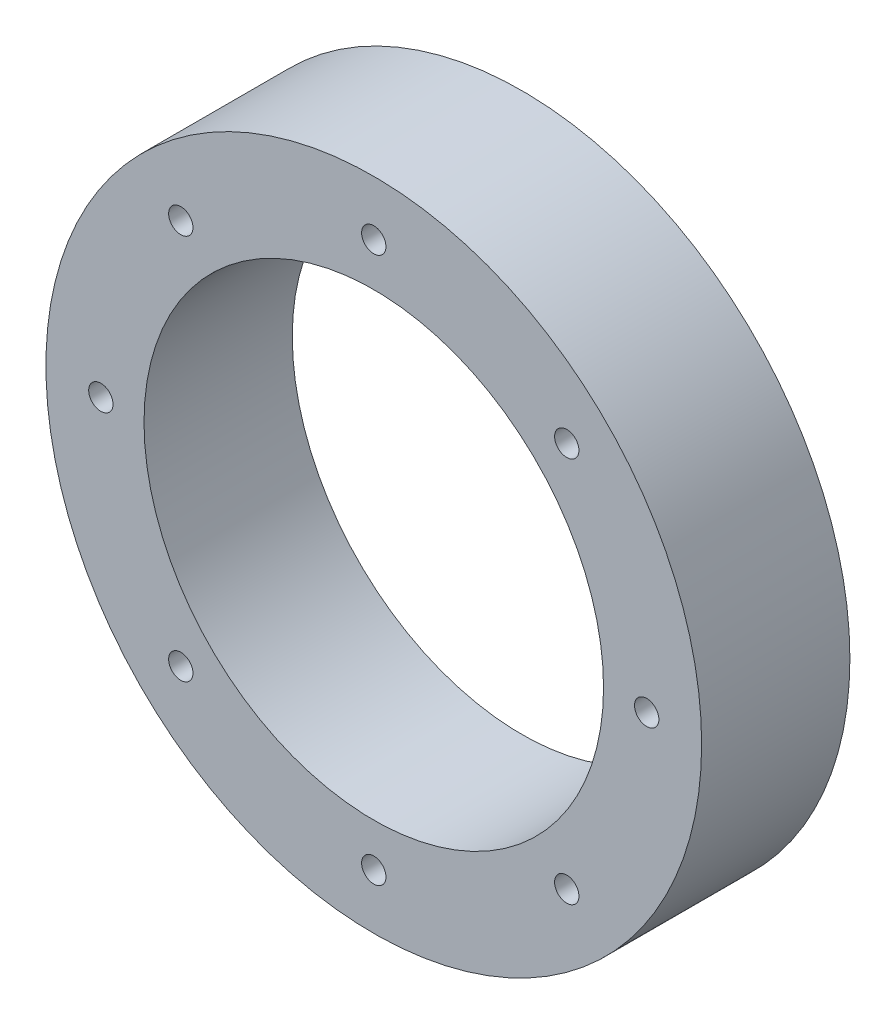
ISO-10303-21;
HEADER;
FILE_DESCRIPTION(('STEP AP214'),'2;1');
FILE_NAME('part.step','',(''),(''),'','','');
FILE_SCHEMA(('AUTOMOTIVE_DESIGN { 1 0 10303 214 1 1 1 1 }'));
ENDSEC;
DATA;
#1=APPLICATION_CONTEXT('core data for automotive mechanical design processes');
#2=APPLICATION_PROTOCOL_DEFINITION('international standard','automotive_design',2000,#1);
#3=PRODUCT_CONTEXT('',#1,'mechanical');
#4=PRODUCT('Part','Part','',(#3));
#5=PRODUCT_RELATED_PRODUCT_CATEGORY('part','',(#4));
#6=PRODUCT_DEFINITION_FORMATION('','',#4);
#7=PRODUCT_DEFINITION_CONTEXT('part definition',#1,'design');
#8=PRODUCT_DEFINITION('design','',#6,#7);
#9=PRODUCT_DEFINITION_SHAPE('','',#8);
#10=(LENGTH_UNIT() NAMED_UNIT(*) SI_UNIT(.MILLI.,.METRE.));
#11=(NAMED_UNIT(*) PLANE_ANGLE_UNIT() SI_UNIT($,.RADIAN.));
#12=(NAMED_UNIT(*) SI_UNIT($,.STERADIAN.) SOLID_ANGLE_UNIT());
#13=UNCERTAINTY_MEASURE_WITH_UNIT(LENGTH_MEASURE(1.E-05),#10,'distance_accuracy_value','');
#14=(GEOMETRIC_REPRESENTATION_CONTEXT(3) GLOBAL_UNCERTAINTY_ASSIGNED_CONTEXT((#13)) GLOBAL_UNIT_ASSIGNED_CONTEXT((#10,
#11,#12)) REPRESENTATION_CONTEXT('',''));
#15=CARTESIAN_POINT('',(0.,0.,0.));
#16=DIRECTION('',(0.,0.,1.));
#17=DIRECTION('',(1.,0.,0.));
#18=AXIS2_PLACEMENT_3D('',#15,#16,#17);
#19=CARTESIAN_POINT('',(0.,0.,10.05));
#20=DIRECTION('',(0.,0.,1.));
#21=DIRECTION('',(1.,0.,0.));
#22=AXIS2_PLACEMENT_3D('',#19,#20,#21);
#23=PLANE('',#22);
#24=CARTESIAN_POINT('',(-37.,3.87554428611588E-13,10.05));
#25=DIRECTION('',(0.,0.,1.));
#26=DIRECTION('',(1.,0.,0.));
#27=AXIS2_PLACEMENT_3D('',#24,#25,#26);
#28=CIRCLE('',#27,1.65);
#29=CARTESIAN_POINT('',(-35.35,3.87554428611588E-13,10.05));
#30=VERTEX_POINT('',#29);
#31=EDGE_CURVE('E109',#30,#30,#28,.T.);
#32=ORIENTED_EDGE('',*,*,#31,.F.);
#33=EDGE_LOOP('',(#32));
#34=FACE_BOUND('',#33,.T.);
#35=CARTESIAN_POINT('',(-2.58369619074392E-13,-37.,10.05));
#36=DIRECTION('',(0.,0.,1.));
#37=DIRECTION('',(1.,0.,0.));
#38=AXIS2_PLACEMENT_3D('',#35,#36,#37);
#39=CIRCLE('',#38,1.65);
#40=CARTESIAN_POINT('',(1.64999999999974,-37.,10.05));
#41=VERTEX_POINT('',#40);
#42=EDGE_CURVE('E94',#41,#41,#39,.T.);
#43=ORIENTED_EDGE('',*,*,#42,.F.);
#44=EDGE_LOOP('',(#43));
#45=FACE_BOUND('',#44,.T.);
#46=CARTESIAN_POINT('',(37.,-1.29184809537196E-13,10.05));
#47=DIRECTION('',(0.,0.,1.));
#48=DIRECTION('',(1.,0.,0.));
#49=AXIS2_PLACEMENT_3D('',#46,#47,#48);
#50=CIRCLE('',#49,1.65);
#51=CARTESIAN_POINT('',(38.65,-1.29184809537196E-13,10.05));
#52=VERTEX_POINT('',#51);
#53=EDGE_CURVE('E79',#52,#52,#50,.T.);
#54=ORIENTED_EDGE('',*,*,#53,.F.);
#55=EDGE_LOOP('',(#54));
#56=FACE_BOUND('',#55,.T.);
#57=CARTESIAN_POINT('',(0.,37.,10.05));
#58=DIRECTION('',(0.,0.,1.));
#59=DIRECTION('',(1.,0.,0.));
#60=AXIS2_PLACEMENT_3D('',#57,#58,#59);
#61=CIRCLE('',#60,1.65);
#62=CARTESIAN_POINT('',(1.65,37.,10.05));
#63=VERTEX_POINT('',#62);
#64=EDGE_CURVE('E65',#63,#63,#61,.T.);
#65=ORIENTED_EDGE('',*,*,#64,.F.);
#66=EDGE_LOOP('',(#65));
#67=FACE_BOUND('',#66,.T.);
#68=CARTESIAN_POINT('',(0.,0.,10.05));
#69=DIRECTION('',(0.,0.,1.));
#70=DIRECTION('',(1.,0.,0.));
#71=AXIS2_PLACEMENT_3D('',#68,#69,#70);
#72=CIRCLE('',#71,44.45);
#73=CARTESIAN_POINT('',(44.45,0.,10.05));
#74=VERTEX_POINT('',#73);
#75=EDGE_CURVE('E10',#74,#74,#72,.T.);
#76=ORIENTED_EDGE('',*,*,#75,.T.);
#77=EDGE_LOOP('',(#76));
#78=FACE_BOUND('',#77,.T.);
#79=CARTESIAN_POINT('',(0.,0.,10.05));
#80=DIRECTION('',(0.,0.,1.));
#81=DIRECTION('',(1.,0.,0.));
#82=AXIS2_PLACEMENT_3D('',#79,#80,#81);
#83=CIRCLE('',#82,31.15);
#84=CARTESIAN_POINT('',(31.15,0.,10.05));
#85=VERTEX_POINT('',#84);
#86=EDGE_CURVE('E57',#85,#85,#83,.T.);
#87=ORIENTED_EDGE('',*,*,#86,.F.);
#88=EDGE_LOOP('',(#87));
#89=FACE_BOUND('',#88,.T.);
#90=CARTESIAN_POINT('',(26.1629509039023,26.1629509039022,10.05));
#91=DIRECTION('',(0.,0.,1.));
#92=DIRECTION('',(1.,0.,0.));
#93=AXIS2_PLACEMENT_3D('',#90,#91,#92);
#94=CIRCLE('',#93,1.65);
#95=CARTESIAN_POINT('',(27.8129509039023,26.1629509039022,10.05));
#96=VERTEX_POINT('',#95);
#97=EDGE_CURVE('E68',#96,#96,#94,.T.);
#98=ORIENTED_EDGE('',*,*,#97,.F.);
#99=EDGE_LOOP('',(#98));
#100=FACE_BOUND('',#99,.T.);
#101=CARTESIAN_POINT('',(26.1629509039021,-26.1629509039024,10.05));
#102=DIRECTION('',(0.,0.,1.));
#103=DIRECTION('',(1.,0.,0.));
#104=AXIS2_PLACEMENT_3D('',#101,#102,#103);
#105=CIRCLE('',#104,1.65);
#106=CARTESIAN_POINT('',(27.8129509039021,-26.1629509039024,10.05));
#107=VERTEX_POINT('',#106);
#108=EDGE_CURVE('E88',#107,#107,#105,.T.);
#109=ORIENTED_EDGE('',*,*,#108,.F.);
#110=EDGE_LOOP('',(#109));
#111=FACE_BOUND('',#110,.T.);
#112=CARTESIAN_POINT('',(-26.1629509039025,-26.162950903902,10.05));
#113=DIRECTION('',(0.,0.,1.));
#114=DIRECTION('',(1.,0.,0.));
#115=AXIS2_PLACEMENT_3D('',#112,#113,#114);
#116=CIRCLE('',#115,1.65);
#117=CARTESIAN_POINT('',(-24.5129509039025,-26.162950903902,10.05));
#118=VERTEX_POINT('',#117);
#119=EDGE_CURVE('E105',#118,#118,#116,.T.);
#120=ORIENTED_EDGE('',*,*,#119,.F.);
#121=EDGE_LOOP('',(#120));
#122=FACE_BOUND('',#121,.T.);
#123=CARTESIAN_POINT('',(-26.1629509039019,26.1629509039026,10.05));
#124=DIRECTION('',(0.,0.,1.));
#125=DIRECTION('',(1.,0.,0.));
#126=AXIS2_PLACEMENT_3D('',#123,#124,#125);
#127=CIRCLE('',#126,1.65);
#128=CARTESIAN_POINT('',(-24.5129509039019,26.1629509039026,10.05));
#129=VERTEX_POINT('',#128);
#130=EDGE_CURVE('E119',#129,#129,#127,.T.);
#131=ORIENTED_EDGE('',*,*,#130,.F.);
#132=EDGE_LOOP('',(#131));
#133=FACE_BOUND('',#132,.T.);
#134=ADVANCED_FACE('F43',(#34,#45,#56,#67,#78,#89,#100,#111,#122,#133),#23,.T.);
#135=CARTESIAN_POINT('',(0.,0.,-10.05));
#136=DIRECTION('',(0.,0.,1.));
#137=DIRECTION('',(1.,0.,0.));
#138=AXIS2_PLACEMENT_3D('',#135,#136,#137);
#139=PLANE('',#138);
#140=CARTESIAN_POINT('',(0.,0.,-10.05));
#141=DIRECTION('',(0.,0.,1.));
#142=DIRECTION('',(1.,0.,0.));
#143=AXIS2_PLACEMENT_3D('',#140,#141,#142);
#144=CIRCLE('',#143,44.45);
#145=CARTESIAN_POINT('',(44.45,0.,-10.05));
#146=VERTEX_POINT('',#145);
#147=EDGE_CURVE('E50',#146,#146,#144,.T.);
#148=ORIENTED_EDGE('',*,*,#147,.F.);
#149=EDGE_LOOP('',(#148));
#150=FACE_BOUND('',#149,.T.);
#151=CARTESIAN_POINT('',(0.,0.,-10.05));
#152=DIRECTION('',(0.,0.,1.));
#153=DIRECTION('',(1.,0.,0.));
#154=AXIS2_PLACEMENT_3D('',#151,#152,#153);
#155=CIRCLE('',#154,31.15);
#156=CARTESIAN_POINT('',(31.15,0.,-10.05));
#157=VERTEX_POINT('',#156);
#158=EDGE_CURVE('E59',#157,#157,#155,.T.);
#159=ORIENTED_EDGE('',*,*,#158,.T.);
#160=EDGE_LOOP('',(#159));
#161=FACE_BOUND('',#160,.T.);
#162=CARTESIAN_POINT('',(0.,37.,-10.05));
#163=DIRECTION('',(0.,0.,1.));
#164=DIRECTION('',(1.,0.,0.));
#165=AXIS2_PLACEMENT_3D('',#162,#163,#164);
#166=CIRCLE('',#165,1.65);
#167=CARTESIAN_POINT('',(1.65,37.,-10.05));
#168=VERTEX_POINT('',#167);
#169=EDGE_CURVE('E67',#168,#168,#166,.T.);
#170=ORIENTED_EDGE('',*,*,#169,.T.);
#171=EDGE_LOOP('',(#170));
#172=FACE_BOUND('',#171,.T.);
#173=CARTESIAN_POINT('',(26.1629509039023,26.1629509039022,-10.05));
#174=DIRECTION('',(0.,0.,1.));
#175=DIRECTION('',(1.,0.,0.));
#176=AXIS2_PLACEMENT_3D('',#173,#174,#175);
#177=CIRCLE('',#176,1.65);
#178=CARTESIAN_POINT('',(27.8129509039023,26.1629509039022,-10.05));
#179=VERTEX_POINT('',#178);
#180=EDGE_CURVE('E74',#179,#179,#177,.T.);
#181=ORIENTED_EDGE('',*,*,#180,.T.);
#182=EDGE_LOOP('',(#181));
#183=FACE_BOUND('',#182,.T.);
#184=CARTESIAN_POINT('',(37.,-1.29184809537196E-13,-10.05));
#185=DIRECTION('',(0.,0.,1.));
#186=DIRECTION('',(1.,0.,0.));
#187=AXIS2_PLACEMENT_3D('',#184,#185,#186);
#188=CIRCLE('',#187,1.65);
#189=CARTESIAN_POINT('',(38.65,-1.29184809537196E-13,-10.05));
#190=VERTEX_POINT('',#189);
#191=EDGE_CURVE('E84',#190,#190,#188,.T.);
#192=ORIENTED_EDGE('',*,*,#191,.T.);
#193=EDGE_LOOP('',(#192));
#194=FACE_BOUND('',#193,.T.);
#195=CARTESIAN_POINT('',(26.1629509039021,-26.1629509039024,-10.05));
#196=DIRECTION('',(0.,0.,1.));
#197=DIRECTION('',(1.,0.,0.));
#198=AXIS2_PLACEMENT_3D('',#195,#196,#197);
#199=CIRCLE('',#198,1.65);
#200=CARTESIAN_POINT('',(27.8129509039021,-26.1629509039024,-10.05));
#201=VERTEX_POINT('',#200);
#202=EDGE_CURVE('E89',#201,#201,#199,.T.);
#203=ORIENTED_EDGE('',*,*,#202,.T.);
#204=EDGE_LOOP('',(#203));
#205=FACE_BOUND('',#204,.T.);
#206=CARTESIAN_POINT('',(-2.58369619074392E-13,-37.,-10.05));
#207=DIRECTION('',(0.,0.,1.));
#208=DIRECTION('',(1.,0.,0.));
#209=AXIS2_PLACEMENT_3D('',#206,#207,#208);
#210=CIRCLE('',#209,1.65);
#211=CARTESIAN_POINT('',(1.64999999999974,-37.,-10.05));
#212=VERTEX_POINT('',#211);
#213=EDGE_CURVE('E98',#212,#212,#210,.T.);
#214=ORIENTED_EDGE('',*,*,#213,.T.);
#215=EDGE_LOOP('',(#214));
#216=FACE_BOUND('',#215,.T.);
#217=CARTESIAN_POINT('',(-26.1629509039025,-26.162950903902,-10.05));
#218=DIRECTION('',(0.,0.,1.));
#219=DIRECTION('',(1.,0.,0.));
#220=AXIS2_PLACEMENT_3D('',#217,#218,#219);
#221=CIRCLE('',#220,1.65);
#222=CARTESIAN_POINT('',(-24.5129509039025,-26.162950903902,-10.05));
#223=VERTEX_POINT('',#222);
#224=EDGE_CURVE('E106',#223,#223,#221,.T.);
#225=ORIENTED_EDGE('',*,*,#224,.T.);
#226=EDGE_LOOP('',(#225));
#227=FACE_BOUND('',#226,.T.);
#228=CARTESIAN_POINT('',(-37.,3.87554428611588E-13,-10.05));
#229=DIRECTION('',(0.,0.,1.));
#230=DIRECTION('',(1.,0.,0.));
#231=AXIS2_PLACEMENT_3D('',#228,#229,#230);
#232=CIRCLE('',#231,1.65);
#233=CARTESIAN_POINT('',(-35.35,3.87554428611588E-13,-10.05));
#234=VERTEX_POINT('',#233);
#235=EDGE_CURVE('E111',#234,#234,#232,.T.);
#236=ORIENTED_EDGE('',*,*,#235,.T.);
#237=EDGE_LOOP('',(#236));
#238=FACE_BOUND('',#237,.T.);
#239=CARTESIAN_POINT('',(-26.1629509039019,26.1629509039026,-10.05));
#240=DIRECTION('',(0.,0.,1.));
#241=DIRECTION('',(1.,0.,0.));
#242=AXIS2_PLACEMENT_3D('',#239,#240,#241);
#243=CIRCLE('',#242,1.65);
#244=CARTESIAN_POINT('',(-24.5129509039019,26.1629509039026,-10.05));
#245=VERTEX_POINT('',#244);
#246=EDGE_CURVE('E124',#245,#245,#243,.T.);
#247=ORIENTED_EDGE('',*,*,#246,.T.);
#248=EDGE_LOOP('',(#247));
#249=FACE_BOUND('',#248,.T.);
#250=ADVANCED_FACE('F131',(#150,#161,#172,#183,#194,#205,#216,#227,#238,#249),#139,.F.);
#251=CARTESIAN_POINT('',(0.,0.,10.05));
#252=DIRECTION('',(0.,0.,-1.));
#253=DIRECTION('',(-1.,0.,0.));
#254=AXIS2_PLACEMENT_3D('',#251,#252,#253);
#255=CYLINDRICAL_SURFACE('',#254,44.45);
#256=ORIENTED_EDGE('',*,*,#75,.F.);
#257=EDGE_LOOP('',(#256));
#258=FACE_BOUND('',#257,.T.);
#259=ORIENTED_EDGE('',*,*,#147,.T.);
#260=EDGE_LOOP('',(#259));
#261=FACE_BOUND('',#260,.T.);
#262=ADVANCED_FACE('F44',(#258,#261),#255,.T.);
#263=CARTESIAN_POINT('',(0.,0.,10.05));
#264=DIRECTION('',(0.,0.,-1.));
#265=DIRECTION('',(-1.,0.,0.));
#266=AXIS2_PLACEMENT_3D('',#263,#264,#265);
#267=CYLINDRICAL_SURFACE('',#266,31.15);
#268=ORIENTED_EDGE('',*,*,#86,.T.);
#269=EDGE_LOOP('',(#268));
#270=FACE_BOUND('',#269,.T.);
#271=ORIENTED_EDGE('',*,*,#158,.F.);
#272=EDGE_LOOP('',(#271));
#273=FACE_BOUND('',#272,.T.);
#274=ADVANCED_FACE('F145',(#270,#273),#267,.F.);
#275=CARTESIAN_POINT('',(0.,37.,10.05));
#276=DIRECTION('',(0.,0.,-1.));
#277=DIRECTION('',(-1.,0.,0.));
#278=AXIS2_PLACEMENT_3D('',#275,#276,#277);
#279=CYLINDRICAL_SURFACE('',#278,1.65);
#280=ORIENTED_EDGE('',*,*,#64,.T.);
#281=EDGE_LOOP('',(#280));
#282=FACE_BOUND('',#281,.T.);
#283=ORIENTED_EDGE('',*,*,#169,.F.);
#284=EDGE_LOOP('',(#283));
#285=FACE_BOUND('',#284,.T.);
#286=ADVANCED_FACE('F150',(#282,#285),#279,.F.);
#287=CARTESIAN_POINT('',(26.1629509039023,26.1629509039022,10.05));
#288=DIRECTION('',(0.,0.,-1.));
#289=DIRECTION('',(-1.,0.,0.));
#290=AXIS2_PLACEMENT_3D('',#287,#288,#289);
#291=CYLINDRICAL_SURFACE('',#290,1.65);
#292=ORIENTED_EDGE('',*,*,#97,.T.);
#293=EDGE_LOOP('',(#292));
#294=FACE_BOUND('',#293,.T.);
#295=ORIENTED_EDGE('',*,*,#180,.F.);
#296=EDGE_LOOP('',(#295));
#297=FACE_BOUND('',#296,.T.);
#298=ADVANCED_FACE('F151',(#294,#297),#291,.F.);
#299=CARTESIAN_POINT('',(37.,-1.29184809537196E-13,10.05));
#300=DIRECTION('',(0.,0.,-1.));
#301=DIRECTION('',(-1.,0.,0.));
#302=AXIS2_PLACEMENT_3D('',#299,#300,#301);
#303=CYLINDRICAL_SURFACE('',#302,1.65);
#304=ORIENTED_EDGE('',*,*,#53,.T.);
#305=EDGE_LOOP('',(#304));
#306=FACE_BOUND('',#305,.T.);
#307=ORIENTED_EDGE('',*,*,#191,.F.);
#308=EDGE_LOOP('',(#307));
#309=FACE_BOUND('',#308,.T.);
#310=ADVANCED_FACE('F154',(#306,#309),#303,.F.);
#311=CARTESIAN_POINT('',(26.1629509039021,-26.1629509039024,10.05));
#312=DIRECTION('',(0.,0.,-1.));
#313=DIRECTION('',(-1.,0.,0.));
#314=AXIS2_PLACEMENT_3D('',#311,#312,#313);
#315=CYLINDRICAL_SURFACE('',#314,1.65);
#316=ORIENTED_EDGE('',*,*,#108,.T.);
#317=EDGE_LOOP('',(#316));
#318=FACE_BOUND('',#317,.T.);
#319=ORIENTED_EDGE('',*,*,#202,.F.);
#320=EDGE_LOOP('',(#319));
#321=FACE_BOUND('',#320,.T.);
#322=ADVANCED_FACE('F157',(#318,#321),#315,.F.);
#323=CARTESIAN_POINT('',(-2.58369619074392E-13,-37.,10.05));
#324=DIRECTION('',(0.,0.,-1.));
#325=DIRECTION('',(-1.,0.,0.));
#326=AXIS2_PLACEMENT_3D('',#323,#324,#325);
#327=CYLINDRICAL_SURFACE('',#326,1.65);
#328=ORIENTED_EDGE('',*,*,#42,.T.);
#329=EDGE_LOOP('',(#328));
#330=FACE_BOUND('',#329,.T.);
#331=ORIENTED_EDGE('',*,*,#213,.F.);
#332=EDGE_LOOP('',(#331));
#333=FACE_BOUND('',#332,.T.);
#334=ADVANCED_FACE('F162',(#330,#333),#327,.F.);
#335=CARTESIAN_POINT('',(-26.1629509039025,-26.162950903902,10.05));
#336=DIRECTION('',(0.,0.,-1.));
#337=DIRECTION('',(-1.,0.,0.));
#338=AXIS2_PLACEMENT_3D('',#335,#336,#337);
#339=CYLINDRICAL_SURFACE('',#338,1.65);
#340=ORIENTED_EDGE('',*,*,#119,.T.);
#341=EDGE_LOOP('',(#340));
#342=FACE_BOUND('',#341,.T.);
#343=ORIENTED_EDGE('',*,*,#224,.F.);
#344=EDGE_LOOP('',(#343));
#345=FACE_BOUND('',#344,.T.);
#346=ADVANCED_FACE('F170',(#342,#345),#339,.F.);
#347=CARTESIAN_POINT('',(-37.,3.87554428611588E-13,10.05));
#348=DIRECTION('',(0.,0.,-1.));
#349=DIRECTION('',(-1.,0.,0.));
#350=AXIS2_PLACEMENT_3D('',#347,#348,#349);
#351=CYLINDRICAL_SURFACE('',#350,1.65);
#352=ORIENTED_EDGE('',*,*,#31,.T.);
#353=EDGE_LOOP('',(#352));
#354=FACE_BOUND('',#353,.T.);
#355=ORIENTED_EDGE('',*,*,#235,.F.);
#356=EDGE_LOOP('',(#355));
#357=FACE_BOUND('',#356,.T.);
#358=ADVANCED_FACE('F172',(#354,#357),#351,.F.);
#359=CARTESIAN_POINT('',(-26.1629509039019,26.1629509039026,10.05));
#360=DIRECTION('',(0.,0.,-1.));
#361=DIRECTION('',(-1.,0.,0.));
#362=AXIS2_PLACEMENT_3D('',#359,#360,#361);
#363=CYLINDRICAL_SURFACE('',#362,1.65);
#364=ORIENTED_EDGE('',*,*,#130,.T.);
#365=EDGE_LOOP('',(#364));
#366=FACE_BOUND('',#365,.T.);
#367=ORIENTED_EDGE('',*,*,#246,.F.);
#368=EDGE_LOOP('',(#367));
#369=FACE_BOUND('',#368,.T.);
#370=ADVANCED_FACE('F128',(#366,#369),#363,.F.);
#371=CLOSED_SHELL('',(#134,#250,#262,#274,#286,#298,#310,#322,#334,#346,#358,#370));
#372=MANIFOLD_SOLID_BREP('B2',#371);
#373=ADVANCED_BREP_SHAPE_REPRESENTATION('',(#18,#372),#14);
#374=SHAPE_DEFINITION_REPRESENTATION(#9,#373);
ENDSEC;
END-ISO-10303-21;
